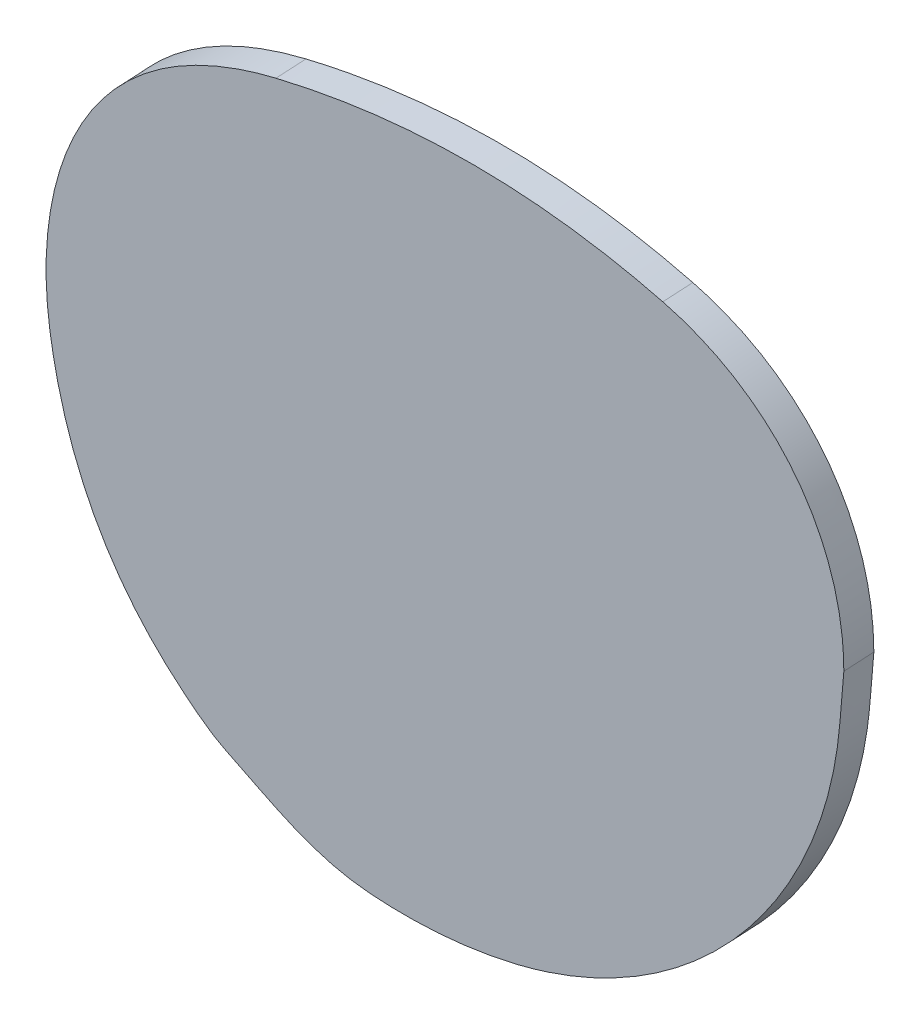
from build123d import *

# Parameters (mm, degrees)
BOSS_EXTRUDE1_DEPTH = 2


with BuildPart() as part:
    # Sketch1 → Boss-Extrude1 (new body)
    with BuildSketch(Plane(origin=(1.494148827, 0, 28.510057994), x_dir=(-0.9986295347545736, 0, 0.0523359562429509), z_dir=(-0.0523359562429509, -1.397107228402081e-14, -0.9986295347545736))):
        with BuildLine():
            add(Edge.make_bspline(
                [(-5.773503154, 38.680254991), (-5.771853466, 40.350723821), (-5.539945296, 41.983459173), (-4.930134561, 43.971950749), (-4.791417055, 44.36777661), (-4.48564565, 45.139527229), (-4.318136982, 45.517212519), (-3.772015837, 46.625851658), (-3.350039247, 47.332518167), (-2.627313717, 48.342244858), (-2.370503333, 48.671437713), (-1.82960919, 49.307669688), (-1.54768261, 49.612359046), (-0.668577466, 50.487449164), (-0.038225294, 51.019049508), (1.309221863, 51.980794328), (2.030960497, 52.412389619), (3.519857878, 53.151937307), (4.290644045, 53.463307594), (5.086451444, 53.719193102)],
                knots=[0, 0, 0, 0, 0.25, 0.25, 0.3125, 0.3125, 0.375, 0.375, 0.5, 0.5, 0.5625, 0.5625, 0.625, 0.625, 0.75, 0.75, 0.875, 0.875, 1, 1, 1, 1], degree=3))
            add(Edge.make_bspline(
                [(5.086451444, 53.719193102), (6.956586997, 54.320520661), (8.856469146, 54.801765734), (12.718389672, 55.513342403), (14.667193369, 55.740904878), (17.607133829, 55.889314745), (18.589512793, 55.906524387), (20.545056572, 55.877994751), (21.520163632, 55.832381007), (24.437775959, 55.604853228), (26.372579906, 55.332341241), (28.297776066, 54.94680372)],
                knots=[0, 0, 0, 0, 0.25, 0.25, 0.5, 0.5, 0.625, 0.625, 0.75, 0.75, 1, 1, 1, 1], degree=3))
            add(Edge.make_bspline(
                [(28.297776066, 54.94680372), (29.415301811, 54.723008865), (30.505485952, 54.423671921), (32.09066469, 53.836252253), (32.610673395, 53.617280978), (33.631835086, 53.127241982), (34.135847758, 52.85432807), (35.591446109, 51.961955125), (36.484736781, 51.27221094), (37.699907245, 50.084156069), (38.086442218, 49.659431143), (38.801909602, 48.773938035), (39.460337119, 47.853609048), (40.010995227, 46.867462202), (40.509985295, 45.849760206), (40.734573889, 45.322311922), (41.323941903, 43.719515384), (41.607136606, 42.623705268), (41.891550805, 40.94508785), (41.96286325, 40.377640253), (42.059103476, 39.243342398), (42.084251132, 38.676613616), (42.095085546, 36.977608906), (42.017086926, 35.846497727), (41.854451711, 34.716934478)],
                knots=[0, 0, 0, 0, 0.125, 0.125, 0.1875, 0.1875, 0.25, 0.25, 0.375, 0.375, 0.4375, 0.4375, 0.5, 0.5625, 0.5625, 0.625, 0.625, 0.75, 0.75, 0.8125, 0.8125, 0.875, 0.875, 1, 1, 1, 1], degree=3))
            add(Edge.make_bspline(
                [(41.854451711, 34.716934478), (41.637031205, 33.20688569), (41.324034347, 31.718377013), (40.679463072, 29.525070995), (40.435406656, 28.801827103), (39.891155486, 27.389755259), (39.590302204, 26.698538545), (38.597441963, 24.671469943), (37.81521564, 23.382157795), (36.443469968, 21.550537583), (35.955893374, 20.961151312), (34.930356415, 19.83483581), (34.391081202, 19.296117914), (33.826118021, 18.781084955)],
                knots=[0, 0, 0, 0, 0.25, 0.25, 0.375, 0.375, 0.5, 0.5, 0.75, 0.75, 0.875, 0.875, 1, 1, 1, 1], degree=3))
            add(Edge.make_bspline(
                [(33.826118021, 18.781084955), (33.441413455, 18.430377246), (33.055815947, 18.08023237), (32.249748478, 17.421578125), (31.830434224, 17.113011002), (31.375752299, 16.857876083)],
                knots=[0, 0, 0, 0, 0.5, 0.5, 1, 1, 1, 1], degree=3))
            add(Edge.make_bspline(
                [(31.375752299, 16.857876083), (30.679958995, 16.467448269), (29.992408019, 16.062647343), (28.607987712, 15.269295), (27.910953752, 14.881172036), (26.478621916, 14.180864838), (25.740903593, 13.869594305), (24.232946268, 13.38346563), (23.460089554, 13.207161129), (22.66708334, 13.102112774)],
                knots=[0, 0, 0, 0, 0.25, 0.25, 0.5, 0.5, 0.75, 0.75, 1, 1, 1, 1], degree=3))
            add(Edge.make_bspline(
                [(22.66708334, 13.102112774), (21.189840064, 12.906423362), (19.698668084, 12.834199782), (16.721958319, 12.935896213), (15.243531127, 13.108901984), (13.783599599, 13.407937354)],
                knots=[0, 0, 0, 0, 0.5, 0.5, 1, 1, 1, 1], degree=3))
            add(Edge.make_bspline(
                [(13.783599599, 13.407937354), (12.36071469, 13.699382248), (10.988230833, 14.119135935), (9.001122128, 14.931091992), (8.350750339, 15.232288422), (7.3932567, 15.730071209), (7.077106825, 15.903673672), (6.450898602, 16.26638664), (6.140476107, 16.455779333), (4.61893875, 17.431970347), (3.486828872, 18.312192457), (1.909439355, 19.773377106), (1.403905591, 20.284069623), (0.433784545, 21.353207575), (-0.031528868, 21.913092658), (-1.340516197, 23.63350332), (-2.10703696, 24.843552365), (-3.100572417, 26.751528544), (-3.405545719, 27.403102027), (-3.96159649, 28.738295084), (-4.211918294, 29.420771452), (-4.870290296, 31.488147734), (-5.190553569, 32.906941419), (-5.482562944, 35.063173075), (-5.542232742, 35.786978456), (-5.660623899, 37.233396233), (-5.714886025, 37.95699962), (-5.773503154, 38.680254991)],
                knots=[0, 0, 0, 0, 0.125, 0.125, 0.1875, 0.1875, 0.21875, 0.21875, 0.25, 0.25, 0.375, 0.375, 0.4375, 0.4375, 0.5, 0.5, 0.625, 0.625, 0.6875, 0.6875, 0.75, 0.75, 0.875, 0.875, 0.9375, 0.9375, 1, 1, 1, 1], degree=3))
        make_face()
    extrude(amount=BOSS_EXTRUDE1_DEPTH)


solid = part.part
